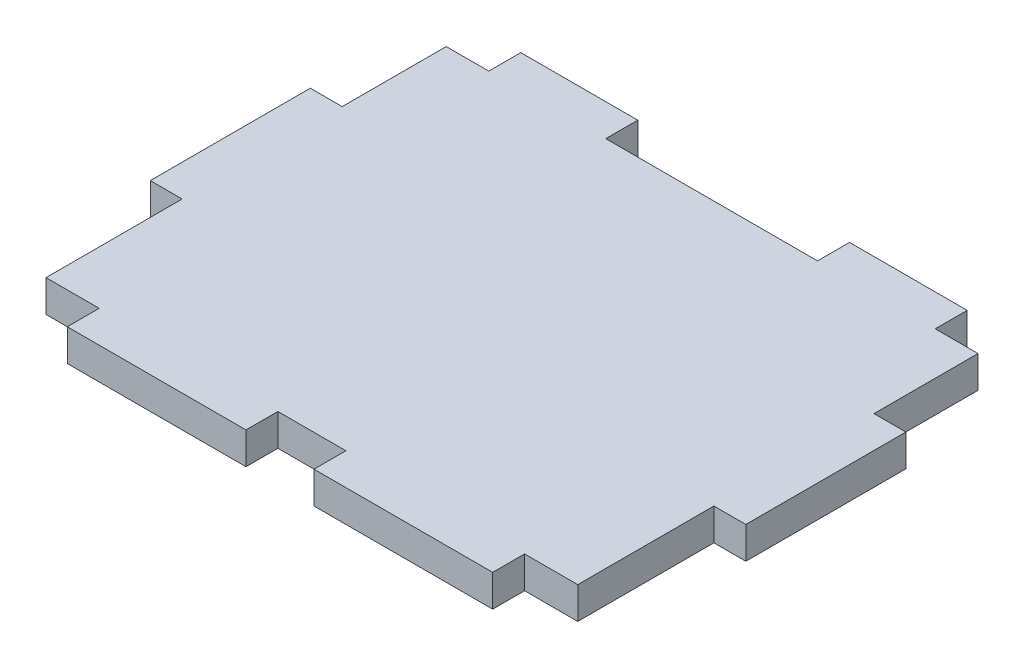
from build123d import *

# Parameters (mm, degrees)
EXTRUDE_1_DEPTH = 3


with BuildPart() as part:
    # Sketch 1 → Extrude 1 (new body)
    with BuildSketch(Plane(origin=(0, 0, 0), x_dir=(1, 0, 0), z_dir=(0, 1, 0))):
        Polygon((-874.437806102, 462.277187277), (-874.437806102, 472.05958728), (-878.462774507, 472.05958728), (-878.462774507, 475.06948728), (-889.527527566, 475.06948728), (-889.527527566, 472.05958728), (-909.437806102, 472.05958728), (-909.437806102, 475.06948728), (-920.437806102, 475.06948728), (-920.437806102, 472.05958728), (-924.437806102, 472.05958728), (-924.437806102, 462.277187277), (-927.437806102, 462.277187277), (-927.437806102, 447.227487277), (-924.437806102, 447.227487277), (-924.437806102, 434.424887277), (-919.437806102, 434.424887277), (-919.437806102, 431.424887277), (-902.635539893, 431.424887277), (-902.635539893, 434.424887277), (-896.240072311, 434.424887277), (-896.240072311, 431.424887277), (-879.437806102, 431.424887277), (-879.437806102, 434.424887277), (-874.437806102, 434.424887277), (-874.437806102, 447.227487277), (-871.437806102, 447.227487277), (-871.437806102, 462.277187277), align=None)
    extrude(amount=EXTRUDE_1_DEPTH)


solid = part.part
